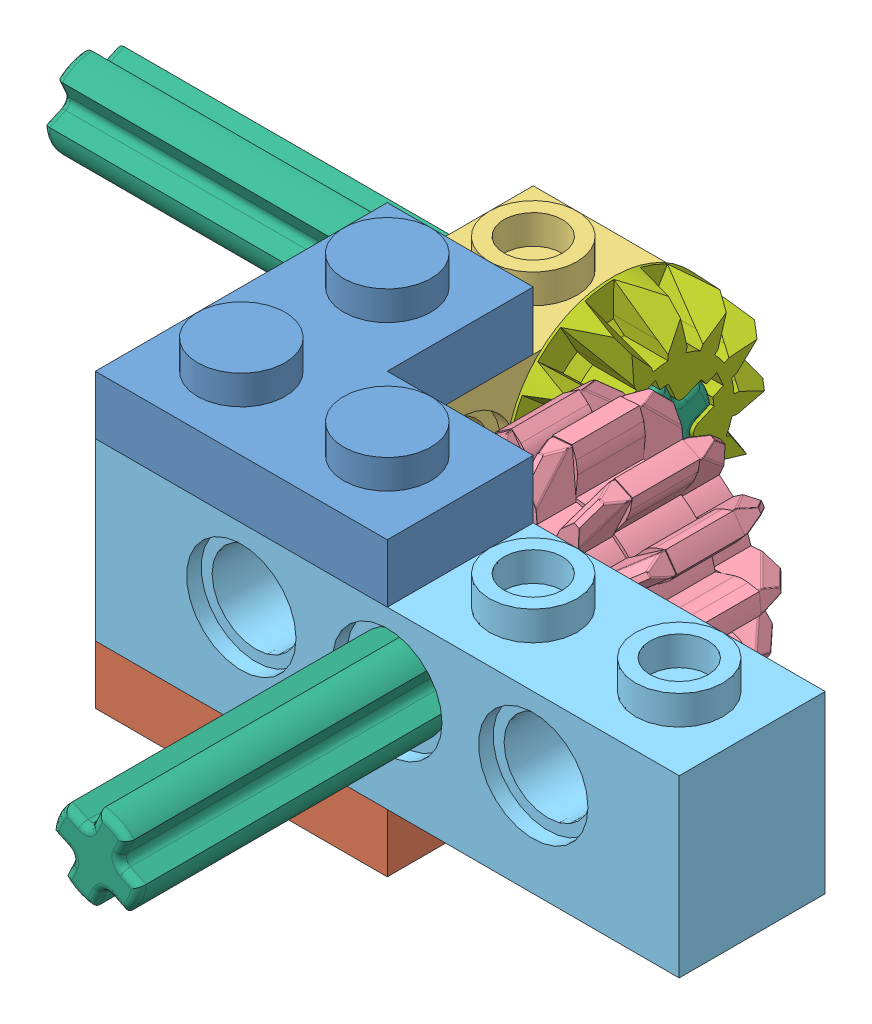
SolidWorks assembly 31.1.SLDASM, configuration Default (file format 11000). Lengths in mm.
Overall size (52.5 17.65 43.58).
8 component instances, 7 part files, 20 mates.
Components (placement in the parent):
- 2420 Plate 2 x 2 Corner - Orange-1: 2420 Plate 2 x 2 Corner - Orange.SLDPRT [Default] at (0.4102 17.6394 1.7707) x (0 0 1) z (-1 0 0) size (16 4.8 16)
- 2420 Plate 2 x 2 Corner - Yellow-1: 2420 Plate 2 x 2 Corner - Yellow.SLDPRT [Default] at (0.4102 4.8394 1.7707) x (0 0 1) z (-1 0 0) size (16 4.8 16)
- 32000 Brick 1 x 2 with Holes - Green-1: 32000 Brick 1 x 2 with Holes - Green.SLDPRT [Default] at (4.4102 12.8394 1.7707) x (0 0 1) z (-1 0 0) size (16 11.2 8)
- 32270 Gear 12 Tooth Double Bevel-1: 32270 Gear 12 Tooth Double Bevel.SLDPRT [Default] at (16.4102 13.6394 5.7707) x (-0.905087 0.425226 0) z (-0.425226 -0.905087 0) size (13.27 8.11 13.27)
- 3701 Brick 1 x 4 with Holes - Red-1: 3701 Brick 1 x 4 with Holes - Red.SLDPRT [Default] at (16.4102 12.8394 13.7707) size (32 11.2 8)
- 3705 Axle 4 - Gray-1: 3705 Axle 4 - Gray.SLDPRT [Default] at (11.9102 13.6394 -2.2293) x (0 0.915825 0.401578) z (0 -0.401578 0.915825) size (4.8 32 4.8)
- 6589 Gear 12 tooth bevel - Gray-1: 6589 Gear 12 tooth bevel - Gray.SLDPRT [Default] at (12.3102 13.6394 -2.2293) x (0 0.931544 -0.363628) z (1 0 0) size (11.7 11.7 3.5)
- 3705 Axle 4 - Gray-2: 3705 Axle 4 - Gray.SLDPRT [Default] at (16.4102 13.6394 33.7707) x (-0.905087 0.425226 0) z (-0.425226 -0.905087 0) size (4.8 32 4.8)
Mates (geometry in assembly coordinates):
- Coincident5: coincident: plane of 2420 Plate 2 x 2 Corner - Yellow-1 through (8.4102 4.8394 17.7707) normal (0 0 1); plane of 3701 Brick 1 x 4 with Holes - Red-1 through (16.4102 12.8394 17.7707) normal (0 0 1)
- Coincident6: coincident: plane of 2420 Plate 2 x 2 Corner - Yellow-1 through (0.4102 4.8394 1.7707) normal (-1 0 0); plane of 3701 Brick 1 x 4 with Holes - Red-1 through (0.4102 17.6394 9.7707) normal (-1 0 0)
- Coincident8: coincident: plane of 2420 Plate 2 x 2 Corner - Yellow-1 through (8.4102 8.0394 17.7707) normal (0 1 0); plane of 3701 Brick 1 x 4 with Holes - Red-1 through (0.4102 8.0394 9.7707) normal (0 -1 0)
- Coincident9: coincident: plane of 2420 Plate 2 x 2 Corner - Yellow-1 through (8.4102 8.0394 17.7707) normal (0 1 0); plane of 32000 Brick 1 x 2 with Holes - Green-1 through (8.4102 8.0394 -6.2293) normal (0 -1 0)
- Coincident10: coincident: plane of 32000 Brick 1 x 2 with Holes - Green-1 through (8.4102 8.0394 9.7707) normal (0 0 1); plane of 3701 Brick 1 x 4 with Holes - Red-1 through (16.4102 12.8394 9.7707) normal (0 0 -1)
- Coincident11: coincident: line of 2420 Plate 2 x 2 Corner - Yellow-1 through (0.4102 8.0394 17.7707) axis (0 0 -1); line of 32000 Brick 1 x 2 with Holes - Green-1 through (0.4102 8.0394 -6.2293) axis (0 0 1)
- Coincident12: coincident: plane of 2420 Plate 2 x 2 Corner - Orange-1 through (8.4102 17.6394 17.7707) normal (0 0 1); plane of 3701 Brick 1 x 4 with Holes - Red-1 through (16.4102 12.8394 17.7707) normal (0 0 1)
- Coincident13: coincident: plane of 2420 Plate 2 x 2 Corner - Orange-1 through (0.4102 17.6394 1.7707) normal (-1 0 0); plane of 3701 Brick 1 x 4 with Holes - Red-1 through (0.4102 17.6394 9.7707) normal (-1 0 0)
- Coincident14: coincident: plane of 2420 Plate 2 x 2 Corner - Orange-1 through (8.4102 17.6394 1.7707) normal (0 -1 0); plane of 3701 Brick 1 x 4 with Holes - Red-1 through (0.4102 17.6394 9.7707) normal (0 1 0)
- Concentric1: concentric: cylinder of 32000 Brick 1 x 2 with Holes - Green-1 through (8.4102 13.6394 -2.2293) axis (-1 0 0) radius 2.4; cylinder of 3705 Axle 4 - Gray-1 through (-20.0898 13.6394 -2.2293) axis (1 0 0) radius 2.4
- Coincident15: coincident: plane of 3705 Axle 4 - Gray-1 through (-20.0898 15.3309 -0.5268) normal (0 -0.401578 0.915825); plane of 6589 Gear 12 tooth bevel - Gray-1 through (8.4102 15.3309 -0.5268) normal (0 0.401578 -0.915825)
- Concentric2: concentric: cylinder of 3705 Axle 4 - Gray-1 through (-20.0898 13.6394 -2.2293) axis (1 0 0) radius 2.4; cylinder of 6589 Gear 12 tooth bevel - Gray-1 through (8.4102 13.6394 -2.2293) axis (1 0 0) radius 2.4
- Coincident16: coincident: plane of 32000 Brick 1 x 2 with Holes - Green-1 through (8.4102 12.8394 1.7707) normal (1 0 0); plane of 6589 Gear 12 tooth bevel - Gray-1 through (8.4102 13.6394 -2.2293) normal (-1 0 0)
- Coincident17: coincident: plane of 3705 Axle 4 - Gray-1 through (11.9102 13.6394 -2.2293) normal (1 0 0); plane of 6589 Gear 12 tooth bevel - Gray-1 through (11.9102 13.6394 -2.2293) normal (1 0 0)
- Concentric3: concentric: cylinder of 3701 Brick 1 x 4 with Holes - Red-1 through (16.4102 13.6394 9.7707) axis (0 0 1) radius 2.4; cylinder of 3705 Axle 4 - Gray-2 through (16.4102 13.6394 1.7707) axis (0 0 1) radius 2.4
- Concentric4: concentric: cylinder of 32270 Gear 12 Tooth Double Bevel-1 through (16.4102 13.6394 9.8282) axis (0 0 -1) radius 2.4; cylinder of 3705 Axle 4 - Gray-2 through (16.4102 13.6394 1.7707) axis (0 0 1) radius 2.4
- Coincident18: coincident: plane of 32270 Gear 12 Tooth Double Bevel-1 through (15.0694 12.8551 9.8282) normal (0.905087 -0.425226 0); plane of 3705 Axle 4 - Gray-2 through (14.6643 11.9927 1.7707) normal (-0.905087 0.425226 0)
- Coincident19: coincident: plane of 32270 Gear 12 Tooth Double Bevel-1 through (16.4102 13.6394 9.7707) normal (0 0 1); plane of 3701 Brick 1 x 4 with Holes - Red-1 through (16.4102 12.8394 9.7707) normal (0 0 -1)
- Coincident20: coincident: plane of 32270 Gear 12 Tooth Double Bevel-1 through (16.4102 13.6394 1.7707) normal (0 0 -1); plane of 3705 Axle 4 - Gray-2 through (16.4102 13.6394 1.7707) normal (0 0 -1)
- GearMate3: gear = 7 mm: circle of 32270 Gear 12 Tooth Double Bevel-1; circle of 6589 Gear 12 tooth bevel - Gray-1
